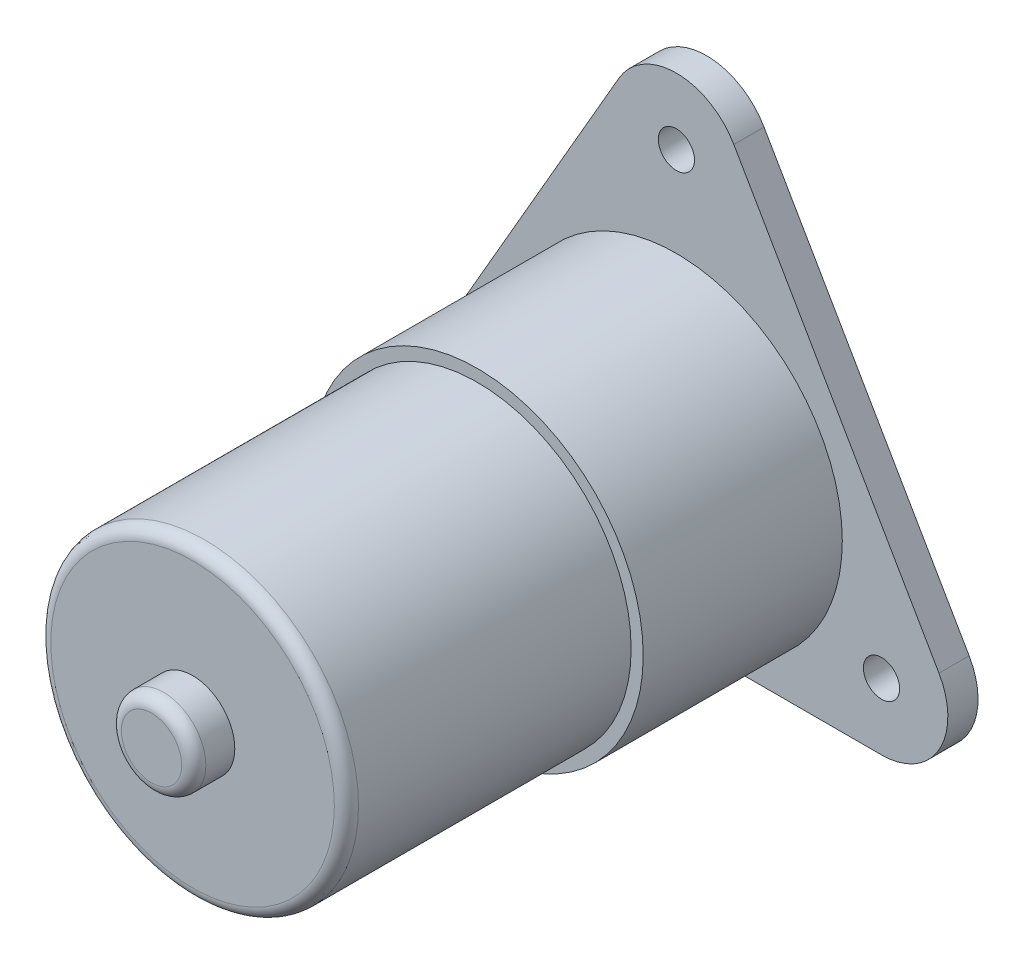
from build123d import *

# Parameters (mm, degrees)
BOSS_EXTRUDE1_START       = 3.175
BOSS_EXTRUDE1_DEPTH       = 3.175
BOSS_EXTRUDE2_DEPTH       = 12.065
SKETCH5_R                 = 3.175
SKETCH5_R_2               = 2.413
BOSS_EXTRUDE3_DEPTH       = 0.0254
FILLET1_R                 = 1.27
F_4_40_TAPPED_HOLE1_D     = 2.2606
F_4_40_TAPPED_HOLE1_DEPTH = 10.1346
F_4_40_TAPPED_HOLE1_TIP   = 0.679152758
SKETCH6_3_R               = 2.159
BOSS_EXTRUDE5_DEPTH       = 1.905
FILLET2_R                 = 0.762
SKETCH7_W                 = 0.4318
SKETCH7_H                 = 3.8862
CUT_EXTRUDE1_DEPTH        = 1.397


with BuildPart() as part:
    # Sketch1 → Revolve-Thin1 (revolve)
    with BuildSketch(Plane(origin=(0, 0, 0), x_dir=(0, 0, -1), z_dir=(1, 0, 0)), mode=Mode.PRIVATE) as revolve_thin1_sk:
        Polygon((0, 0), (0, 4.445), (4.318, 4.445), (4.318, 16.1925), (34.29, 16.1925), (34.29, 17.4625), (55.245, 17.4625), (55.245, 0), (52.705, 0), (52.705, 14.9225), (36.83, 14.9225), (36.83, 13.6525), (6.858, 13.6525), (6.858, 1.905), (2.54, 1.905), (2.54, 0), align=None)
    revolve(revolve_thin1_sk.sketch.rotate(Axis((0, 0, 0), (0, 0, -1)), 90), axis=Axis((0, 0, 0), (0, 0, -1)))

    # Sketch3 → Boss-Extrude1 (add)
    with BuildSketch(Plane(origin=(0, 0, -55.245), x_dir=(-1, 0, 0), z_dir=(0, 0, -1)).offset(BOSS_EXTRUDE1_START)):
        with BuildLine():
            ThreePointArc((-13.97, -10.4775), (-16.047331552, -6.886367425), (-17.21891026, -2.906550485))
            Line((-17.21891026, -2.906550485), (-20.6375, -8.827721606))
            ThreePointArc((-20.6375, -8.827721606), (-19.940221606, -9.525), (-19.685, -10.4775))
            Line((-19.685, -10.4775), (-13.97, -10.4775))
        make_face()
        with BuildLine():
            Line((13.97, -10.4775), (-13.97, -10.4775))
            ThreePointArc((-13.97, -10.4775), (-8.461927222, -15.275296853), (-1.4732, -17.40024678))
            Line((-1.4732, -17.40024678), (-1.4732, -14.5161))
            ThreePointArc((-1.4732, -14.5161), (0, -13.0429), (1.4732, -14.5161))
            Line((1.4732, -14.5161), (1.4732, -17.40024678))
            ThreePointArc((1.4732, -17.40024678), (8.461927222, -15.275296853), (13.97, -10.4775))
        make_face()
        with BuildLine():
            Line((20.6375, -8.827721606), (17.21891026, -2.906550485))
            ThreePointArc((17.21891026, -2.906550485), (16.047331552, -6.886367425), (13.97, -10.4775))
            Line((13.97, -10.4775), (19.685, -10.4775))
            ThreePointArc((19.685, -10.4775), (19.940221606, -9.525), (20.6375, -8.827721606))
        make_face()
        with BuildLine():
            ThreePointArc((17.4625, 0), (14.34095263, 9.963733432), (6.092308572, 16.365288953))
            Line((6.092308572, 16.365288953), (9.865247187, 9.830367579))
            ThreePointArc((9.865247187, 9.830367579), (10.871725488, 9.1186), (10.984895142, 7.891080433))
            Line((10.984895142, 7.891080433), (17.21891026, -2.906550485))
            ThreePointArc((17.21891026, -2.906550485), (17.401496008, -1.458369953), (17.4625, 0))
        make_face()
        with BuildLine():
            Line((-10.984895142, 7.891080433), (-17.21891026, -2.906550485))
            ThreePointArc((-17.21891026, -2.906550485), (-16.047331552, -6.886367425), (-13.97, -10.4775))
            Line((-13.97, -10.4775), (13.97, -10.4775))
            ThreePointArc((13.97, -10.4775), (16.047331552, -6.886367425), (17.21891026, -2.906550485))
            Line((17.21891026, -2.906550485), (10.984895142, 7.891080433))
            ThreePointArc((10.984895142, 7.891080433), (10.446512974, 7.179182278), (9.595896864, 6.9088))
            Line((9.595896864, 6.9088), (8.638278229, 6.9088))
            ThreePointArc((8.638278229, 6.9088), (0, -0.381), (-8.638278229, 6.9088))
            Line((-8.638278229, 6.9088), (-9.595896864, 6.9088))
            ThreePointArc((-9.595896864, 6.9088), (-10.446512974, 7.179182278), (-10.984895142, 7.891080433))
        make_face()
        with BuildLine():
            Line((-6.092308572, 16.365288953), (-0.9525, 25.267698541))
            ThreePointArc((-0.9525, 25.267698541), (-0.9525, 28.56725533), (1.905, 26.917476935))
            ThreePointArc((1.905, 26.917476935), (1.649778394, 25.964976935), (0.9525, 25.267698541))
            Line((0.9525, 25.267698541), (6.092308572, 16.365288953))
            ThreePointArc((6.092308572, 16.365288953), (14.34095263, 9.963733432), (17.4625, 0))
            ThreePointArc((17.4625, 0), (17.401496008, -1.458369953), (17.21891026, -2.906550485))
            Line((17.21891026, -2.906550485), (20.6375, -8.827721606))
            ThreePointArc((20.6375, -8.827721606), (22.5425, -8.827721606), (23.495, -10.4775))
            ThreePointArc((23.495, -10.4775), (21.59, -12.3825), (19.685, -10.4775))
            Line((19.685, -10.4775), (13.97, -10.4775))
            ThreePointArc((13.97, -10.4775), (8.461927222, -15.275296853), (1.4732, -17.40024678))
            Line((1.4732, -17.40024678), (1.4732, -17.4625))
            Line((1.4732, -17.4625), (21.59, -17.4625))
            ThreePointArc((21.59, -17.4625), (27.639187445, -13.97), (27.639187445, -6.985))
            Line((27.639187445, -6.985), (6.049187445, 30.409976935))
            ThreePointArc((6.049187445, 30.409976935), (0, 33.902476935), (-6.049187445, 30.409976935))
            Line((-6.049187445, 30.409976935), (-27.639187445, -6.985))
            ThreePointArc((-27.639187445, -6.985), (-27.639187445, -13.97), (-21.59, -17.4625))
            Line((-21.59, -17.4625), (-1.4732, -17.4625))
            Line((-1.4732, -17.4625), (-1.4732, -17.40024678))
            ThreePointArc((-1.4732, -17.40024678), (-8.461927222, -15.275296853), (-13.97, -10.4775))
            Line((-13.97, -10.4775), (-19.685, -10.4775))
            ThreePointArc((-19.685, -10.4775), (-23.239778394, -11.43), (-20.6375, -8.827721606))
            Line((-20.6375, -8.827721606), (-17.21891026, -2.906550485))
            ThreePointArc((-17.21891026, -2.906550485), (-15.122968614, 8.73125), (-6.092308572, 16.365288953))
        make_face()
        with BuildLine():
            Line((-9.865247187, 9.830367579), (-6.092308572, 16.365288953))
            ThreePointArc((-6.092308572, 16.365288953), (-15.122968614, 8.73125), (-17.21891026, -2.906550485))
            Line((-17.21891026, -2.906550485), (-10.984895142, 7.891080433))
            ThreePointArc((-10.984895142, 7.891080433), (-10.871725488, 9.1186), (-9.865247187, 9.830367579))
        make_face()
        with BuildLine():
            ThreePointArc((0.9525, 25.267698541), (0, 25.012476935), (-0.9525, 25.267698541))
            Line((-0.9525, 25.267698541), (-6.092308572, 16.365288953))
            ThreePointArc((-6.092308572, 16.365288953), (0, 17.4625), (6.092308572, 16.365288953))
            Line((6.092308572, 16.365288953), (0.9525, 25.267698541))
        make_face()
        with BuildLine():
            ThreePointArc((6.092308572, 16.365288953), (0, 17.4625), (-6.092308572, 16.365288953))
            Line((-6.092308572, 16.365288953), (-9.865247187, 9.830367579))
            ThreePointArc((-9.865247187, 9.830367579), (-9.731143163, 9.848978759), (-9.595896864, 9.8552))
            Line((-9.595896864, 9.8552), (-8.638278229, 9.8552))
            ThreePointArc((-8.638278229, 9.8552), (0, 17.145), (8.638278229, 9.8552))
            Line((8.638278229, 9.8552), (9.595896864, 9.8552))
            ThreePointArc((9.595896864, 9.8552), (9.731143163, 9.848978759), (9.865247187, 9.830367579))
            Line((9.865247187, 9.830367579), (6.092308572, 16.365288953))
        make_face()
    extrude(amount=-BOSS_EXTRUDE1_DEPTH)

    # Sketch4 → Boss-Extrude2 (add)
    with BuildSketch(Plane(origin=(0, 0, -55.245), x_dir=(-1, 0, 0), z_dir=(0, 0, -1))):
        with BuildLine():
            Line((0, 10.795), (2.413, 8.382))
            ThreePointArc((2.413, 8.382), (-1.706248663, 6.675751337), (0, 10.795))
        make_face()
    extrude(amount=BOSS_EXTRUDE2_DEPTH)

    # Sketch5 → Boss-Extrude3 (add)
    with BuildSketch(Plane(origin=(0, 0, -55.245), x_dir=(-1, 0, 0), z_dir=(0, 0, -1))):
        with Locations((0, 8.382)):
            Circle(SKETCH5_R)
        with Locations((0, 8.382)):
            Circle(SKETCH5_R_2, mode=Mode.SUBTRACT)
    extrude(amount=BOSS_EXTRUDE3_DEPTH)

    # Fillet1
    fillet1_edges = [part.edges().sort_by_distance(p)[0] for p in [
        (-4.445, 0, 0),
        (-16.1925, 0, -4.318),
    ]]
    fillet(fillet1_edges, radius=FILLET1_R)

    # 4-40 Tapped Hole1
    with Locations(Plane(origin=(0, 0, -58.42), x_dir=(-1, 0, 0), z_dir=(0, 0, -1))):
        with Locations((0, -14.5161), (-9.595896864, 8.382), (9.595896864, 8.382)):
            Hole(F_4_40_TAPPED_HOLE1_D / 2, depth=F_4_40_TAPPED_HOLE1_DEPTH)
            with Locations((0, 0, -(F_4_40_TAPPED_HOLE1_DEPTH + F_4_40_TAPPED_HOLE1_TIP / 2))):  # 118° drill point
                Cone(0, F_4_40_TAPPED_HOLE1_D / 2, F_4_40_TAPPED_HOLE1_TIP, mode=Mode.SUBTRACT)

    # Sketch6_3 → Boss-Extrude5 (add)
    with BuildSketch(Plane(origin=(0, 0, -58.42), x_dir=(-1, 0, 0), z_dir=(0, 0, -1))):
        with Locations(Location((-9.595896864, 8.382, 0), (0, 0, 61.214444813))):
            Circle(SKETCH6_3_R)
        with Locations(Location((9.595896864, 8.382, 0), (0, 0, 241.214444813))):
            Circle(SKETCH6_3_R)
        with Locations(Location((0, -14.5161, 0), (0, 0, 226.97221509))):
            Circle(SKETCH6_3_R)
    extrude(amount=BOSS_EXTRUDE5_DEPTH)

    # Fillet2
    fillet2_edges = [part.edges().sort_by_distance(p)[0] for p in [
        (10.635526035, 6.489791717, -60.325),
        (-10.635526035, 10.274208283, -60.325),
        (-1.4732, -12.937821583, -60.325),
    ]]
    fillet(fillet2_edges, radius=FILLET2_R)

    # Sketch7 → Cut-Extrude1 (cut)
    with BuildSketch(Plane(origin=(0, 0, -60.325), x_dir=(-1, 0, 0), z_dir=(0, 0, -1))):
        with Locations((-9.595896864, 8.382)):
            Rectangle(SKETCH7_W, SKETCH7_H)
        with Locations((9.595896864, 8.382)):
            Rectangle(SKETCH7_W, SKETCH7_H)
        with Locations((0, -14.5161)):
            Rectangle(SKETCH7_W, SKETCH7_H)
    extrude(amount=-CUT_EXTRUDE1_DEPTH, mode=Mode.SUBTRACT)


solid = part.part
